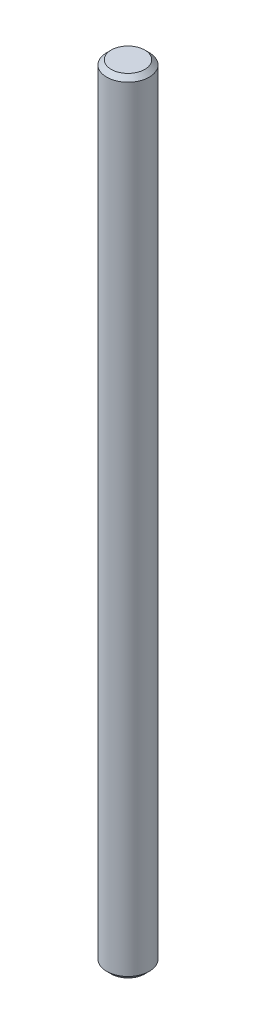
ISO-10303-21;
HEADER;
FILE_DESCRIPTION(('STEP AP214'),'2;1');
FILE_NAME('part.step','',(''),(''),'','','');
FILE_SCHEMA(('AUTOMOTIVE_DESIGN { 1 0 10303 214 1 1 1 1 }'));
ENDSEC;
DATA;
#1=APPLICATION_CONTEXT('core data for automotive mechanical design processes');
#2=APPLICATION_PROTOCOL_DEFINITION('international standard','automotive_design',2000,#1);
#3=PRODUCT_CONTEXT('',#1,'mechanical');
#4=PRODUCT('Part','Part','',(#3));
#5=PRODUCT_RELATED_PRODUCT_CATEGORY('part','',(#4));
#6=PRODUCT_DEFINITION_FORMATION('','',#4);
#7=PRODUCT_DEFINITION_CONTEXT('part definition',#1,'design');
#8=PRODUCT_DEFINITION('design','',#6,#7);
#9=PRODUCT_DEFINITION_SHAPE('','',#8);
#10=(LENGTH_UNIT() NAMED_UNIT(*) SI_UNIT(.MILLI.,.METRE.));
#11=(NAMED_UNIT(*) PLANE_ANGLE_UNIT() SI_UNIT($,.RADIAN.));
#12=(NAMED_UNIT(*) SI_UNIT($,.STERADIAN.) SOLID_ANGLE_UNIT());
#13=UNCERTAINTY_MEASURE_WITH_UNIT(LENGTH_MEASURE(1.E-05),#10,'distance_accuracy_value','');
#14=(GEOMETRIC_REPRESENTATION_CONTEXT(3) GLOBAL_UNCERTAINTY_ASSIGNED_CONTEXT((#13)) GLOBAL_UNIT_ASSIGNED_CONTEXT((#10,
#11,#12)) REPRESENTATION_CONTEXT('',''));
#15=CARTESIAN_POINT('',(0.,0.,0.));
#16=DIRECTION('',(0.,0.,1.));
#17=DIRECTION('',(1.,0.,0.));
#18=AXIS2_PLACEMENT_3D('',#15,#16,#17);
#19=CARTESIAN_POINT('',(0.,35.,0.));
#20=DIRECTION('',(0.,-1.,0.));
#21=DIRECTION('',(0.,0.,-1.));
#22=AXIS2_PLACEMENT_3D('',#19,#20,#21);
#23=CYLINDRICAL_SURFACE('',#22,0.95);
#24=CARTESIAN_POINT('',(0.,0.200000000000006,0.));
#25=DIRECTION('',(0.,1.,0.));
#26=DIRECTION('',(0.,0.,1.));
#27=AXIS2_PLACEMENT_3D('',#24,#25,#26);
#28=CIRCLE('',#27,0.95);
#29=CARTESIAN_POINT('',(0.,0.200000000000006,0.95));
#30=VERTEX_POINT('',#29);
#31=EDGE_CURVE('E53',#30,#30,#28,.T.);
#32=ORIENTED_EDGE('',*,*,#31,.T.);
#33=EDGE_LOOP('',(#32));
#34=FACE_BOUND('',#33,.T.);
#35=CARTESIAN_POINT('',(0.,34.8,0.));
#36=DIRECTION('',(0.,1.,0.));
#37=DIRECTION('',(0.,0.,1.));
#38=AXIS2_PLACEMENT_3D('',#35,#36,#37);
#39=CIRCLE('',#38,0.95);
#40=CARTESIAN_POINT('',(0.,34.8,0.95));
#41=VERTEX_POINT('',#40);
#42=EDGE_CURVE('E57',#41,#41,#39,.F.);
#43=ORIENTED_EDGE('',*,*,#42,.T.);
#44=EDGE_LOOP('',(#43));
#45=FACE_BOUND('',#44,.T.);
#46=ADVANCED_FACE('F41',(#34,#45),#23,.T.);
#47=CARTESIAN_POINT('',(0.,35.,0.));
#48=DIRECTION('',(0.,1.,0.));
#49=DIRECTION('',(0.,0.,1.));
#50=AXIS2_PLACEMENT_3D('',#47,#48,#49);
#51=PLANE('',#50);
#52=CARTESIAN_POINT('',(0.,35.,0.));
#53=DIRECTION('',(0.,1.,0.));
#54=DIRECTION('',(0.,0.,1.));
#55=AXIS2_PLACEMENT_3D('',#52,#53,#54);
#56=CIRCLE('',#55,0.750000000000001);
#57=CARTESIAN_POINT('',(0.,35.,0.750000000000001));
#58=VERTEX_POINT('',#57);
#59=EDGE_CURVE('E10',#58,#58,#56,.T.);
#60=ORIENTED_EDGE('',*,*,#59,.T.);
#61=EDGE_LOOP('',(#60));
#62=FACE_BOUND('',#61,.T.);
#63=ADVANCED_FACE('F73',(#62),#51,.T.);
#64=CARTESIAN_POINT('',(0.,0.,0.));
#65=DIRECTION('',(0.,1.,0.));
#66=DIRECTION('',(0.,0.,1.));
#67=AXIS2_PLACEMENT_3D('',#64,#65,#66);
#68=PLANE('',#67);
#69=CARTESIAN_POINT('',(0.,0.,0.));
#70=DIRECTION('',(0.,1.,0.));
#71=DIRECTION('',(0.,0.,1.));
#72=AXIS2_PLACEMENT_3D('',#69,#70,#71);
#73=CIRCLE('',#72,0.749999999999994);
#74=CARTESIAN_POINT('',(0.,0.,0.749999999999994));
#75=VERTEX_POINT('',#74);
#76=EDGE_CURVE('E49',#75,#75,#73,.F.);
#77=ORIENTED_EDGE('',*,*,#76,.T.);
#78=EDGE_LOOP('',(#77));
#79=FACE_BOUND('',#78,.T.);
#80=ADVANCED_FACE('F70',(#79),#68,.F.);
#81=CARTESIAN_POINT('',(0.,0.200000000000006,0.));
#82=DIRECTION('',(0.,1.,0.));
#83=DIRECTION('',(0.,0.,1.));
#84=AXIS2_PLACEMENT_3D('',#81,#82,#83);
#85=CONICAL_SURFACE('',#84,0.95,0.785398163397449);
#86=ORIENTED_EDGE('',*,*,#76,.F.);
#87=EDGE_LOOP('',(#86));
#88=FACE_BOUND('',#87,.T.);
#89=ORIENTED_EDGE('',*,*,#31,.F.);
#90=EDGE_LOOP('',(#89));
#91=FACE_BOUND('',#90,.T.);
#92=ADVANCED_FACE('F66',(#88,#91),#85,.T.);
#93=CARTESIAN_POINT('',(0.,35.,0.));
#94=DIRECTION('',(0.,-1.,0.));
#95=DIRECTION('',(0.,0.,-1.));
#96=AXIS2_PLACEMENT_3D('',#93,#94,#95);
#97=CONICAL_SURFACE('',#96,0.750000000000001,0.785398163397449);
#98=ORIENTED_EDGE('',*,*,#42,.F.);
#99=EDGE_LOOP('',(#98));
#100=FACE_BOUND('',#99,.T.);
#101=ORIENTED_EDGE('',*,*,#59,.F.);
#102=EDGE_LOOP('',(#101));
#103=FACE_BOUND('',#102,.T.);
#104=ADVANCED_FACE('F44',(#100,#103),#97,.T.);
#105=CLOSED_SHELL('',(#46,#63,#80,#92,#104));
#106=MANIFOLD_SOLID_BREP('B2',#105);
#107=ADVANCED_BREP_SHAPE_REPRESENTATION('',(#18,#106),#14);
#108=SHAPE_DEFINITION_REPRESENTATION(#9,#107);
ENDSEC;
END-ISO-10303-21;
